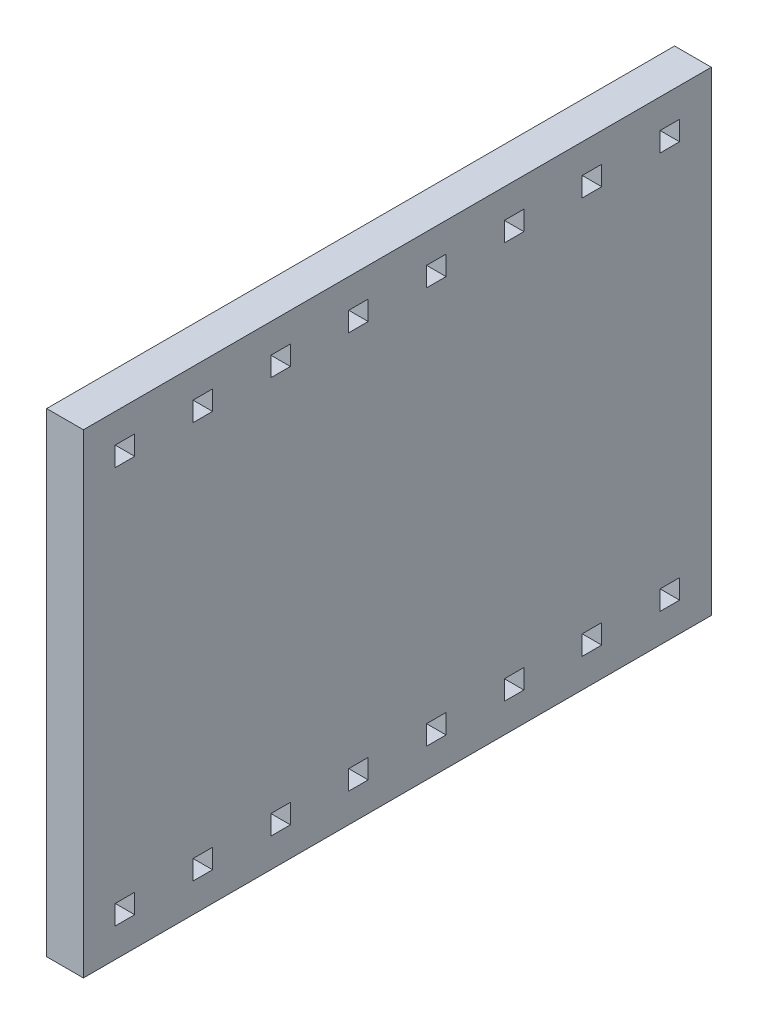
from build123d import *

# Parameters (mm, degrees)
CROQUIS1_W              = 20.5
CROQUIS1_H              = 15.5
SALIENTE_EXTRUIR1_DEPTH = 1.2
CROQUIS2_W              = 0.636
CROQUIS2_H              = 0.636
CORTAR_EXTRUIR1_DEPTH   = 1.2


with BuildPart() as part:
    # Croquis1 → Saliente-Extruir1 (new body)
    with BuildSketch(Plane(origin=(0, 0, 0), x_dir=(0, 0, -1), z_dir=(1, 0, 0))):
        with Locations((10.25, -7.75)):
            Rectangle(CROQUIS1_W, CROQUIS1_H)
    extrude(amount=SALIENTE_EXTRUIR1_DEPTH)

    # Croquis2 → Cortar-Extruir1 (cut)
    with BuildSketch(Plane(origin=(1.2, 0, 0), x_dir=(0, 0, -1), z_dir=(1, 0, 0))):
        with Locations((14.0615, -14.2295)):
            Rectangle(CROQUIS2_W, CROQUIS2_H)
        with Locations((16.6025, -14.2295)):
            Rectangle(CROQUIS2_W, CROQUIS2_H)
        with Locations((1.3565, -14.2295)):
            Rectangle(CROQUIS2_W, CROQUIS2_H)
        with Locations((19.1435, -14.2295)):
            Rectangle(CROQUIS2_W, CROQUIS2_H)
        with Locations((11.5205, -14.2295)):
            Rectangle(CROQUIS2_W, CROQUIS2_H)
        with Locations((3.8975, -14.2295)):
            Rectangle(CROQUIS2_W, CROQUIS2_H)
        with Locations((6.4385, -14.2295)):
            Rectangle(CROQUIS2_W, CROQUIS2_H)
        with Locations((8.9795, -14.2295)):
            Rectangle(CROQUIS2_W, CROQUIS2_H)
        with Locations((8.9795, -1.2705)):
            Rectangle(CROQUIS2_W, CROQUIS2_H)
        with Locations((6.4385, -1.2705)):
            Rectangle(CROQUIS2_W, CROQUIS2_H)
        with Locations((3.8975, -1.2705)):
            Rectangle(CROQUIS2_W, CROQUIS2_H)
        with Locations((11.5205, -1.2705)):
            Rectangle(CROQUIS2_W, CROQUIS2_H)
        with Locations((1.3565, -1.2705)):
            Rectangle(CROQUIS2_W, CROQUIS2_H)
        with Locations((19.1435, -1.2705)):
            Rectangle(CROQUIS2_W, CROQUIS2_H)
        with Locations((16.6025, -1.2705)):
            Rectangle(CROQUIS2_W, CROQUIS2_H)
        with Locations((14.0615, -1.2705)):
            Rectangle(CROQUIS2_W, CROQUIS2_H)
    extrude(amount=-CORTAR_EXTRUIR1_DEPTH, mode=Mode.SUBTRACT)


solid = part.part
